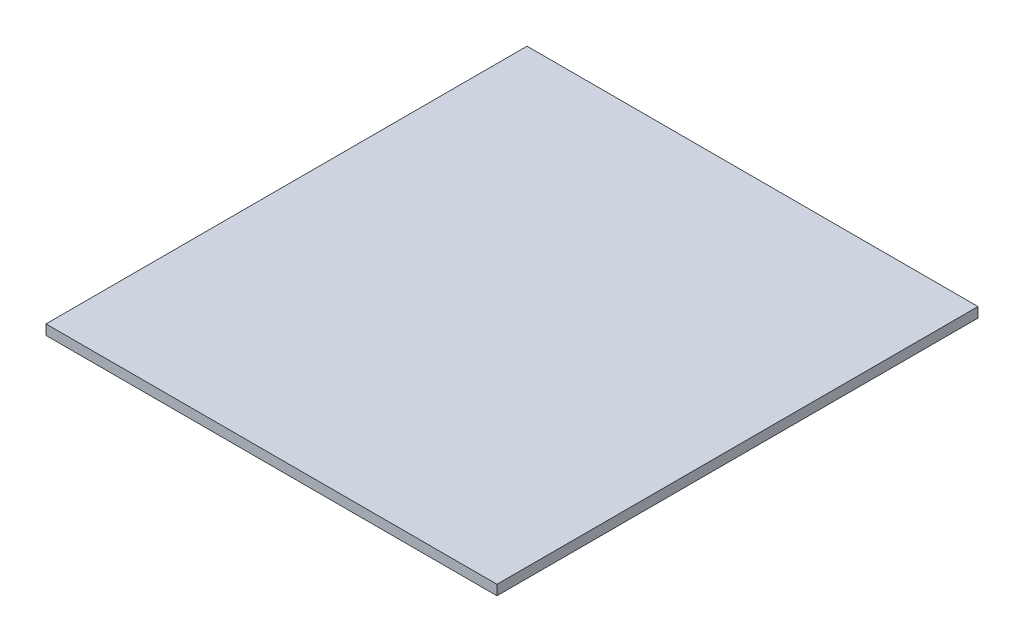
from build123d import *

# Parameters (mm, degrees)
SKETCH1_W           = 1143
SKETCH1_H           = 1219.2
BOSS_EXTRUDE1_DEPTH = 25.4


with BuildPart() as part:
    # Sketch1 → Boss-Extrude1 (new body)
    with BuildSketch(Plane(origin=(0, 0, 0), x_dir=(1, 0, 0), z_dir=(0, 1, 0))):
        Rectangle(SKETCH1_W, SKETCH1_H)
    extrude(amount=BOSS_EXTRUDE1_DEPTH)


solid = part.part
